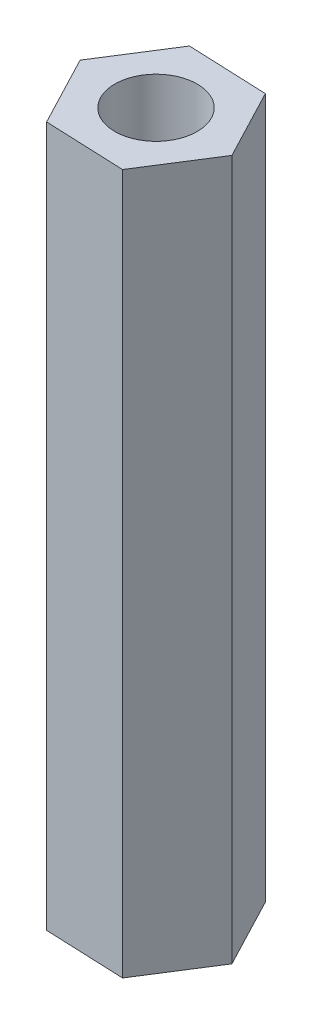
from build123d import *

# Parameters (mm, degrees)
SKIZZE1_R                       = 1.5
AUFSATZ_LINEAR_AUSTRAGEN1_DEPTH = 25.5


with BuildPart() as part:
    # Skizze1 → Aufsatz-Linear austragen1 (new body)
    with BuildSketch(Plane(origin=(0, 0, 0), x_dir=(1, 0, 0), z_dir=(0, 1, 0))):
        Polygon((1.338535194, -2.557666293), (2.884271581, -0.119627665), (1.545736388, 2.438038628), (-1.338535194, 2.557666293), (-2.884271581, 0.119627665), (-1.545736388, -2.438038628), align=None)
        with Locations(Location((0, 0, 0), (0, 0, 270))):
            Circle(SKIZZE1_R, mode=Mode.SUBTRACT)
    extrude(amount=AUFSATZ_LINEAR_AUSTRAGEN1_DEPTH)


solid = part.part
